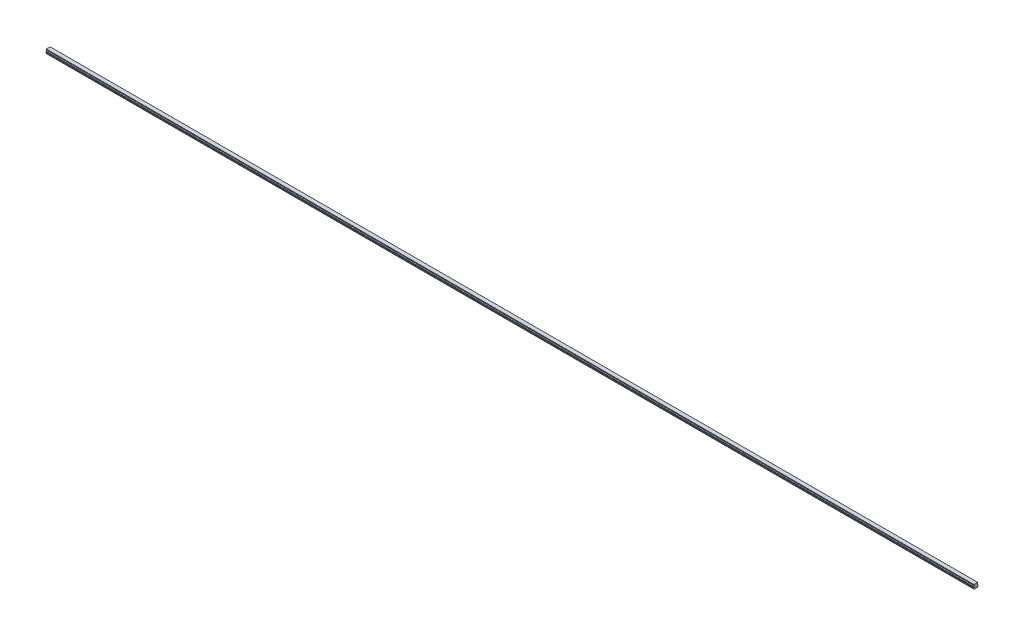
from build123d import *

# Parameters (mm, degrees)
BOSS_EXTRUDE1_DEPTH        = 3180
SKETCH3_R                  = 2.5
SKETCH3_R_2                = 2.1
CUT_EXTRUDE3_DEPTH         = 7
SKETCH3_2_R                = 2.1
CUT_EXTRUDE4_DEPTH         = 9.5
CHAMFER1_SIZE              = 0.4
LPATTERN2_COUNT            = 53
LPATTERN2_PITCH            = 60
CHAMFER1_OF_LPATTERN2_SIZE = 0.4


with BuildPart() as part:
    # Sketch1 → Boss-Extrude1 (new body)
    with BuildSketch(Plane(origin=(0, 0, 0), x_dir=(0, 0, -1), z_dir=(1, 0, 0))):
        with BuildLine():
            Line((6.59, 14), (-6.59, 14))
            Line((-6.59, 14), (-6.59, 13.15))
            Line((-6.59, 13.15), (-6.96, 12.356532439))
            Line((-6.96, 12.356532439), (-6.96, 11.435174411))
            ThreePointArc((-6.96, 11.435174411), (-5.25, 9.5), (-6.96, 7.564825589))
            Line((-6.96, 7.564825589), (-6.96, 6.643467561))
            Line((-6.96, 6.643467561), (-6.59, 5.85))
            Line((-6.59, 5.85), (-7.032116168, 4.2))
            Line((-7.032116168, 4.2), (-7.5, 3.929867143))
            Line((-7.5, 3.929867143), (-7.5, 1.4))
            Line((-7.5, 1.4), (-6.1, 0))
            Line((-6.1, 0), (-3.65, 0))
            Line((-3.65, 0), (-3.25, 0.4))
            Line((-3.25, 0.4), (3.25, 0.4))
            Line((3.25, 0.4), (3.65, 0))
            Line((3.65, 0), (6.1, 0))
            Line((6.1, 0), (7.5, 1.4))
            Line((7.5, 1.4), (7.5, 3.929867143))
            Line((7.5, 3.929867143), (7.032116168, 4.2))
            Line((7.032116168, 4.2), (6.59, 5.85))
            Line((6.59, 5.85), (6.96, 6.643467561))
            Line((6.96, 6.643467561), (6.96, 7.564825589))
            ThreePointArc((6.96, 7.564825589), (5.25, 9.5), (6.96, 11.435174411))
            Line((6.96, 11.435174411), (6.96, 12.356532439))
            Line((6.96, 12.356532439), (6.59, 13.15))
            Line((6.59, 13.15), (6.59, 14))
        make_face()
    extrude(amount=BOSS_EXTRUDE1_DEPTH)

    # Sketch3 → Cut-Extrude3 (cut)
    with BuildSketch(Plane.XZ):
        with Locations(Location((30, 0, 0), (0, 0, 270))):
            Circle(SKETCH3_R)
        with Locations(Location((30, 0, 0), (0, 0, 270))):
            Circle(SKETCH3_R_2, mode=Mode.SUBTRACT)
    cut_extrude3 = extrude(amount=-CUT_EXTRUDE3_DEPTH, mode=Mode.SUBTRACT)

    # Sketch3_2 → Cut-Extrude4 (cut)
    with BuildSketch(Plane.XZ):
        with Locations(Location((30, 0, 0), (0, 0, 270))):
            Circle(SKETCH3_2_R)
    cut_extrude4 = extrude(amount=-CUT_EXTRUDE4_DEPTH, mode=Mode.SUBTRACT)

    # Cut-Extrude5 cone 1 section (on through the dimple's axis) → Cut-Extrude5 (revolve, cut)
    with BuildSketch(Plane(origin=(30, 9.5, 0), x_dir=(0, 0, -1), z_dir=(1, 0, 0))):
        Polygon((0, 0), (2.1, 0), (0, 1.212435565), align=None)
    revolve(axis=Axis((30, 9.5, 0), (0, 1, 0)), mode=Mode.SUBTRACT)

    # Chamfer1
    chamfer1_edges = [part.edges().sort_by_distance(p)[0] for p in [
        (30, 0.4, 2.5),
    ]]
    chamfer(chamfer1_edges, length=CHAMFER1_SIZE)

    # LPattern2: Cut-Extrude3, Cut-Extrude4 ×53
    with Locations(*[(i * LPATTERN2_PITCH, 0, 0) for i in range(1, LPATTERN2_COUNT)]):
        add(cut_extrude3, mode=Mode.SUBTRACT)
        add(cut_extrude4, mode=Mode.SUBTRACT)

    # Chamfer1 of LPattern2
    chamfer1_of_lpattern2_edges = [part.edges().sort_by_distance(p)[0] for p in [
        (90, 0.4, 2.5),
        (150, 0.4, 2.5),
        (210, 0.4, 2.5),
        (270, 0.4, 2.5),
        (330, 0.4, 2.5),
        (390, 0.4, 2.5),
        (450, 0.4, 2.5),
        (510, 0.4, 2.5),
        (570, 0.4, 2.5),
        (630, 0.4, 2.5),
        (690, 0.4, 2.5),
        (750, 0.4, 2.5),
        (810, 0.4, 2.5),
        (870, 0.4, 2.5),
        (930, 0.4, 2.5),
        (990, 0.4, 2.5),
        (1050, 0.4, 2.5),
        (1110, 0.4, 2.5),
        (1170, 0.4, 2.5),
        (1230, 0.4, 2.5),
        (1290, 0.4, 2.5),
        (1350, 0.4, 2.5),
        (1410, 0.4, 2.5),
        (1470, 0.4, 2.5),
        (1530, 0.4, 2.5),
        (1590, 0.4, 2.5),
        (1650, 0.4, 2.5),
        (1710, 0.4, 2.5),
        (1770, 0.4, 2.5),
        (1830, 0.4, 2.5),
        (1890, 0.4, 2.5),
        (1950, 0.4, 2.5),
        (2010, 0.4, 2.5),
        (2070, 0.4, 2.5),
        (2130, 0.4, 2.5),
        (2190, 0.4, 2.5),
        (2250, 0.4, 2.5),
        (2310, 0.4, 2.5),
        (2370, 0.4, 2.5),
        (2430, 0.4, 2.5),
        (2490, 0.4, 2.5),
        (2550, 0.4, 2.5),
        (2610, 0.4, 2.5),
        (2670, 0.4, 2.5),
        (2730, 0.4, 2.5),
        (2790, 0.4, 2.5),
        (2850, 0.4, 2.5),
        (2910, 0.4, 2.5),
        (2970, 0.4, 2.5),
        (3030, 0.4, 2.5),
        (3090, 0.4, 2.5),
        (3150, 0.4, 2.5),
    ]]
    chamfer(chamfer1_of_lpattern2_edges, length=CHAMFER1_OF_LPATTERN2_SIZE)


solid = part.part
